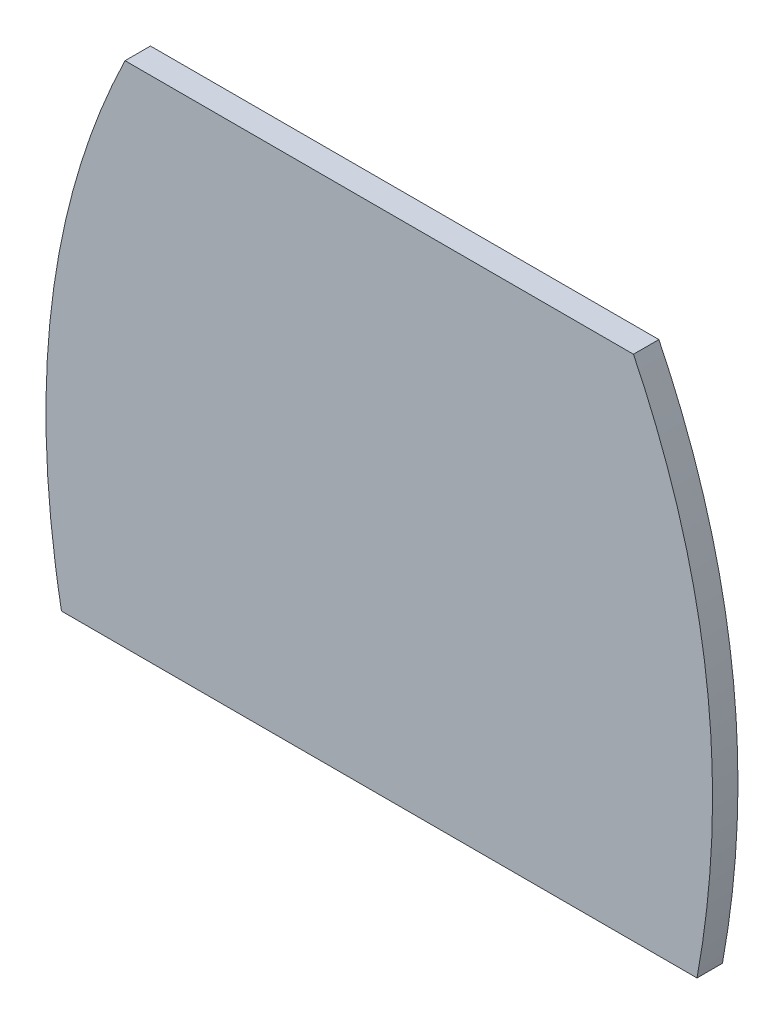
ISO-10303-21;
HEADER;
FILE_DESCRIPTION(('STEP AP214'),'2;1');
FILE_NAME('part.step','',(''),(''),'','','');
FILE_SCHEMA(('AUTOMOTIVE_DESIGN { 1 0 10303 214 1 1 1 1 }'));
ENDSEC;
DATA;
#1=APPLICATION_CONTEXT('core data for automotive mechanical design processes');
#2=APPLICATION_PROTOCOL_DEFINITION('international standard','automotive_design',2000,#1);
#3=PRODUCT_CONTEXT('',#1,'mechanical');
#4=PRODUCT('Part','Part','',(#3));
#5=PRODUCT_RELATED_PRODUCT_CATEGORY('part','',(#4));
#6=PRODUCT_DEFINITION_FORMATION('','',#4);
#7=PRODUCT_DEFINITION_CONTEXT('part definition',#1,'design');
#8=PRODUCT_DEFINITION('design','',#6,#7);
#9=PRODUCT_DEFINITION_SHAPE('','',#8);
#10=(LENGTH_UNIT() NAMED_UNIT(*) SI_UNIT(.MILLI.,.METRE.));
#11=(NAMED_UNIT(*) PLANE_ANGLE_UNIT() SI_UNIT($,.RADIAN.));
#12=(NAMED_UNIT(*) SI_UNIT($,.STERADIAN.) SOLID_ANGLE_UNIT());
#13=UNCERTAINTY_MEASURE_WITH_UNIT(LENGTH_MEASURE(1.E-05),#10,'distance_accuracy_value','');
#14=(GEOMETRIC_REPRESENTATION_CONTEXT(3) GLOBAL_UNCERTAINTY_ASSIGNED_CONTEXT((#13)) GLOBAL_UNIT_ASSIGNED_CONTEXT((#10,
#11,#12)) REPRESENTATION_CONTEXT('',''));
#15=CARTESIAN_POINT('',(0.,0.,0.));
#16=DIRECTION('',(0.,0.,1.));
#17=DIRECTION('',(1.,0.,0.));
#18=AXIS2_PLACEMENT_3D('',#15,#16,#17);
#19=CARTESIAN_POINT('',(-14.2884433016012,40.,2.));
#20=CARTESIAN_POINT('',(-23.2661313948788,21.5369504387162,2.));
#21=CARTESIAN_POINT('',(-19.2884433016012,0.,2.));
#22=B_SPLINE_CURVE_WITH_KNOTS('',2,(#19,#20,#21),.UNSPECIFIED.,.F.,.F.,(3,3),(0.,1.),.UNSPECIFIED.);
#23=DIRECTION('',(0.,0.,-1.));
#24=VECTOR('',#23,1.);
#25=SURFACE_OF_LINEAR_EXTRUSION('',#22,#24);
#26=CARTESIAN_POINT('',(-14.2884433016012,40.,0.));
#27=CARTESIAN_POINT('',(-23.2661313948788,21.5369504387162,0.));
#28=CARTESIAN_POINT('',(-19.2884433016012,0.,0.));
#29=B_SPLINE_CURVE_WITH_KNOTS('',2,(#26,#27,#28),.UNSPECIFIED.,.F.,.F.,(3,3),(0.,1.),.UNSPECIFIED.);
#30=CARTESIAN_POINT('',(-14.2884433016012,40.,0.));
#31=VERTEX_POINT('',#30);
#32=CARTESIAN_POINT('',(-19.2884433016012,0.,0.));
#33=VERTEX_POINT('',#32);
#34=EDGE_CURVE('E116',#31,#33,#29,.T.);
#35=ORIENTED_EDGE('',*,*,#34,.T.);
#36=DIRECTION('',(0.,0.,-1.));
#37=VECTOR('',#36,1.);
#38=CARTESIAN_POINT('',(-19.2884433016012,0.,2.));
#39=LINE('',#38,#37);
#40=CARTESIAN_POINT('',(-19.2884433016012,0.,2.));
#41=VERTEX_POINT('',#40);
#42=EDGE_CURVE('E11',#41,#33,#39,.T.);
#43=ORIENTED_EDGE('',*,*,#42,.F.);
#44=CARTESIAN_POINT('',(-14.2884433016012,40.,2.));
#45=VERTEX_POINT('',#44);
#46=EDGE_CURVE('E85',#45,#41,#22,.T.);
#47=ORIENTED_EDGE('',*,*,#46,.F.);
#48=DIRECTION('',(0.,0.,-1.));
#49=VECTOR('',#48,1.);
#50=CARTESIAN_POINT('',(-14.2884433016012,40.,2.));
#51=LINE('',#50,#49);
#52=EDGE_CURVE('E93',#45,#31,#51,.T.);
#53=ORIENTED_EDGE('',*,*,#52,.T.);
#54=EDGE_LOOP('',(#35,#43,#47,#53));
#55=FACE_BOUND('',#54,.T.);
#56=ADVANCED_FACE('F33',(#55),#25,.F.);
#57=CARTESIAN_POINT('',(-19.2884433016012,0.,2.));
#58=DIRECTION('',(0.,1.,0.));
#59=DIRECTION('',(0.,0.,1.));
#60=AXIS2_PLACEMENT_3D('',#57,#58,#59);
#61=PLANE('',#60);
#62=DIRECTION('',(1.,0.,0.));
#63=VECTOR('',#62,1.);
#64=CARTESIAN_POINT('',(-19.2884433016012,0.,0.));
#65=LINE('',#64,#63);
#66=CARTESIAN_POINT('',(30.7115566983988,0.,0.));
#67=VERTEX_POINT('',#66);
#68=EDGE_CURVE('E89',#33,#67,#65,.T.);
#69=ORIENTED_EDGE('',*,*,#68,.T.);
#70=DIRECTION('',(0.,0.,-1.));
#71=VECTOR('',#70,1.);
#72=CARTESIAN_POINT('',(30.7115566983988,0.,2.));
#73=LINE('',#72,#71);
#74=CARTESIAN_POINT('',(30.7115566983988,0.,2.));
#75=VERTEX_POINT('',#74);
#76=EDGE_CURVE('E42',#75,#67,#73,.T.);
#77=ORIENTED_EDGE('',*,*,#76,.F.);
#78=DIRECTION('',(1.,0.,0.));
#79=VECTOR('',#78,1.);
#80=CARTESIAN_POINT('',(-19.2884433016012,0.,2.));
#81=LINE('',#80,#79);
#82=EDGE_CURVE('E80',#41,#75,#81,.T.);
#83=ORIENTED_EDGE('',*,*,#82,.F.);
#84=ORIENTED_EDGE('',*,*,#42,.T.);
#85=EDGE_LOOP('',(#69,#77,#83,#84));
#86=FACE_BOUND('',#85,.T.);
#87=ADVANCED_FACE('F88',(#86),#61,.F.);
#88=CARTESIAN_POINT('',(30.7115566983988,0.,2.));
#89=CARTESIAN_POINT('',(34.6892447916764,21.5369504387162,2.));
#90=CARTESIAN_POINT('',(25.7115566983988,40.,2.));
#91=B_SPLINE_CURVE_WITH_KNOTS('',2,(#88,#89,#90),.UNSPECIFIED.,.F.,.F.,(3,3),(0.,1.),.UNSPECIFIED.);
#92=DIRECTION('',(0.,0.,-1.));
#93=VECTOR('',#92,1.);
#94=SURFACE_OF_LINEAR_EXTRUSION('',#91,#93);
#95=CARTESIAN_POINT('',(30.7115566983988,0.,0.));
#96=CARTESIAN_POINT('',(34.6892447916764,21.5369504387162,0.));
#97=CARTESIAN_POINT('',(25.7115566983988,40.,0.));
#98=B_SPLINE_CURVE_WITH_KNOTS('',2,(#95,#96,#97),.UNSPECIFIED.,.F.,.F.,(3,3),(0.,1.),.UNSPECIFIED.);
#99=CARTESIAN_POINT('',(25.7115566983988,40.,0.));
#100=VERTEX_POINT('',#99);
#101=EDGE_CURVE('E67',#67,#100,#98,.T.);
#102=ORIENTED_EDGE('',*,*,#101,.T.);
#103=DIRECTION('',(0.,0.,-1.));
#104=VECTOR('',#103,1.);
#105=CARTESIAN_POINT('',(25.7115566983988,40.,2.));
#106=LINE('',#105,#104);
#107=CARTESIAN_POINT('',(25.7115566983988,40.,2.));
#108=VERTEX_POINT('',#107);
#109=EDGE_CURVE('E90',#108,#100,#106,.T.);
#110=ORIENTED_EDGE('',*,*,#109,.F.);
#111=EDGE_CURVE('E83',#75,#108,#91,.T.);
#112=ORIENTED_EDGE('',*,*,#111,.F.);
#113=ORIENTED_EDGE('',*,*,#76,.T.);
#114=EDGE_LOOP('',(#102,#110,#112,#113));
#115=FACE_BOUND('',#114,.T.);
#116=ADVANCED_FACE('F91',(#115),#94,.F.);
#117=CARTESIAN_POINT('',(-14.2884433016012,40.,2.));
#118=DIRECTION('',(0.,-1.,0.));
#119=DIRECTION('',(1.,0.,0.));
#120=AXIS2_PLACEMENT_3D('',#117,#118,#119);
#121=PLANE('',#120);
#122=DIRECTION('',(-1.,0.,0.));
#123=VECTOR('',#122,1.);
#124=CARTESIAN_POINT('',(-14.2884433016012,40.,0.));
#125=LINE('',#124,#123);
#126=EDGE_CURVE('E73',#100,#31,#125,.T.);
#127=ORIENTED_EDGE('',*,*,#126,.T.);
#128=ORIENTED_EDGE('',*,*,#52,.F.);
#129=DIRECTION('',(-1.,0.,0.));
#130=VECTOR('',#129,1.);
#131=CARTESIAN_POINT('',(-14.2884433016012,40.,2.));
#132=LINE('',#131,#130);
#133=EDGE_CURVE('E50',#108,#45,#132,.T.);
#134=ORIENTED_EDGE('',*,*,#133,.F.);
#135=ORIENTED_EDGE('',*,*,#109,.T.);
#136=EDGE_LOOP('',(#127,#128,#134,#135));
#137=FACE_BOUND('',#136,.T.);
#138=ADVANCED_FACE('F105',(#137),#121,.F.);
#139=CARTESIAN_POINT('',(-20.02728734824,20.7684752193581,2.));
#140=DIRECTION('',(0.,0.,1.));
#141=DIRECTION('',(1.,0.,0.));
#142=AXIS2_PLACEMENT_3D('',#139,#140,#141);
#143=PLANE('',#142);
#144=ORIENTED_EDGE('',*,*,#46,.T.);
#145=ORIENTED_EDGE('',*,*,#82,.T.);
#146=ORIENTED_EDGE('',*,*,#111,.T.);
#147=ORIENTED_EDGE('',*,*,#133,.T.);
#148=EDGE_LOOP('',(#144,#145,#146,#147));
#149=FACE_BOUND('',#148,.T.);
#150=ADVANCED_FACE('F81',(#149),#143,.T.);
#151=CARTESIAN_POINT('',(-20.02728734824,20.7684752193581,0.));
#152=DIRECTION('',(0.,0.,1.));
#153=DIRECTION('',(1.,0.,0.));
#154=AXIS2_PLACEMENT_3D('',#151,#152,#153);
#155=PLANE('',#154);
#156=ORIENTED_EDGE('',*,*,#34,.F.);
#157=ORIENTED_EDGE('',*,*,#126,.F.);
#158=ORIENTED_EDGE('',*,*,#101,.F.);
#159=ORIENTED_EDGE('',*,*,#68,.F.);
#160=EDGE_LOOP('',(#156,#157,#158,#159));
#161=FACE_BOUND('',#160,.T.);
#162=ADVANCED_FACE('F133',(#161),#155,.F.);
#163=CLOSED_SHELL('',(#56,#87,#116,#138,#150,#162));
#164=MANIFOLD_SOLID_BREP('B2',#163);
#165=ADVANCED_BREP_SHAPE_REPRESENTATION('',(#18,#164),#14);
#166=SHAPE_DEFINITION_REPRESENTATION(#9,#165);
ENDSEC;
END-ISO-10303-21;
